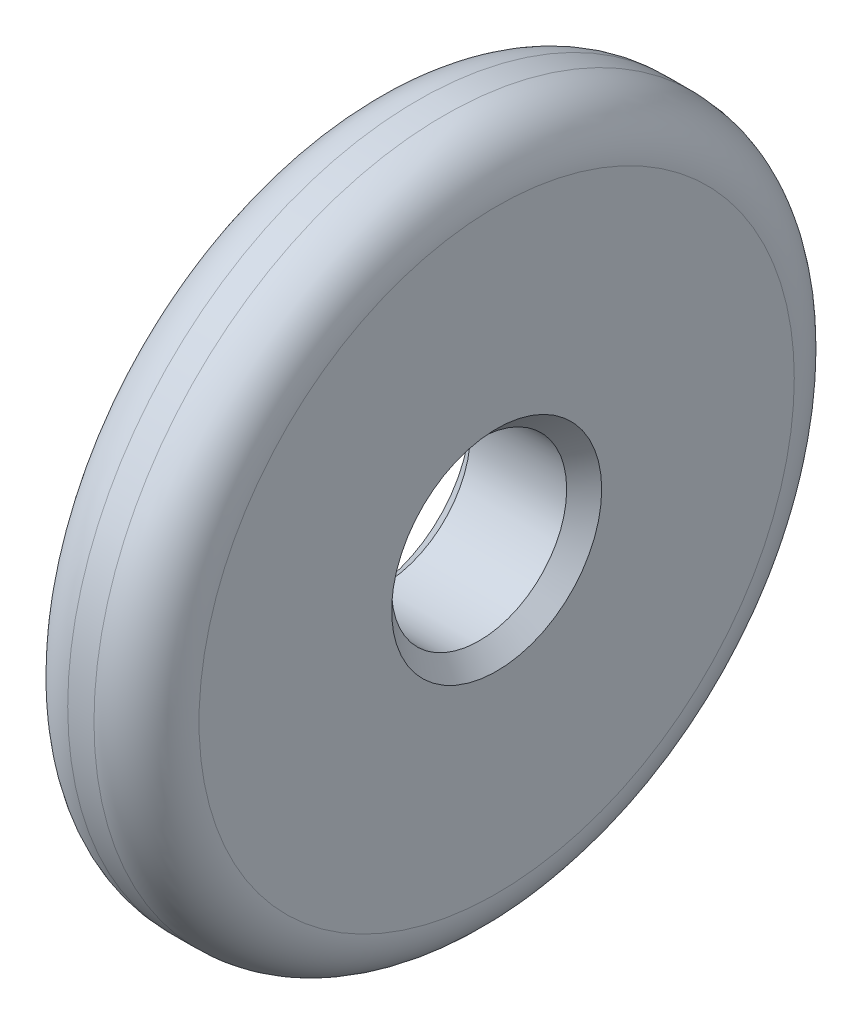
ISO-10303-21;
HEADER;
FILE_DESCRIPTION(('STEP AP214'),'2;1');
FILE_NAME('part.step','',(''),(''),'','','');
FILE_SCHEMA(('AUTOMOTIVE_DESIGN { 1 0 10303 214 1 1 1 1 }'));
ENDSEC;
DATA;
#1=APPLICATION_CONTEXT('core data for automotive mechanical design processes');
#2=APPLICATION_PROTOCOL_DEFINITION('international standard','automotive_design',2000,#1);
#3=PRODUCT_CONTEXT('',#1,'mechanical');
#4=PRODUCT('Part','Part','',(#3));
#5=PRODUCT_RELATED_PRODUCT_CATEGORY('part','',(#4));
#6=PRODUCT_DEFINITION_FORMATION('','',#4);
#7=PRODUCT_DEFINITION_CONTEXT('part definition',#1,'design');
#8=PRODUCT_DEFINITION('design','',#6,#7);
#9=PRODUCT_DEFINITION_SHAPE('','',#8);
#10=(LENGTH_UNIT() NAMED_UNIT(*) SI_UNIT(.MILLI.,.METRE.));
#11=(NAMED_UNIT(*) PLANE_ANGLE_UNIT() SI_UNIT($,.RADIAN.));
#12=(NAMED_UNIT(*) SI_UNIT($,.STERADIAN.) SOLID_ANGLE_UNIT());
#13=UNCERTAINTY_MEASURE_WITH_UNIT(LENGTH_MEASURE(1.E-05),#10,'distance_accuracy_value','');
#14=(GEOMETRIC_REPRESENTATION_CONTEXT(3) GLOBAL_UNCERTAINTY_ASSIGNED_CONTEXT((#13)) GLOBAL_UNIT_ASSIGNED_CONTEXT((#10,
#11,#12)) REPRESENTATION_CONTEXT('',''));
#15=CARTESIAN_POINT('',(0.,0.,0.));
#16=DIRECTION('',(0.,0.,1.));
#17=DIRECTION('',(1.,0.,0.));
#18=AXIS2_PLACEMENT_3D('',#15,#16,#17);
#19=CARTESIAN_POINT('',(3.75,0.,0.));
#20=DIRECTION('',(-1.,0.,0.));
#21=DIRECTION('',(0.,0.,1.));
#22=AXIS2_PLACEMENT_3D('',#19,#20,#21);
#23=CYLINDRICAL_SURFACE('',#22,20.);
#24=CARTESIAN_POINT('',(-0.75,0.,0.));
#25=DIRECTION('',(1.,0.,0.));
#26=DIRECTION('',(0.,0.,-1.));
#27=AXIS2_PLACEMENT_3D('',#24,#25,#26);
#28=CIRCLE('',#27,20.);
#29=CARTESIAN_POINT('',(-0.75,0.,-20.));
#30=VERTEX_POINT('',#29);
#31=EDGE_CURVE('E45',#30,#30,#28,.T.);
#32=ORIENTED_EDGE('',*,*,#31,.T.);
#33=EDGE_LOOP('',(#32));
#34=FACE_BOUND('',#33,.T.);
#35=CARTESIAN_POINT('',(0.75,0.,0.));
#36=DIRECTION('',(1.,0.,0.));
#37=DIRECTION('',(0.,0.,-1.));
#38=AXIS2_PLACEMENT_3D('',#35,#36,#37);
#39=CIRCLE('',#38,20.);
#40=CARTESIAN_POINT('',(0.75,0.,-20.));
#41=VERTEX_POINT('',#40);
#42=EDGE_CURVE('E49',#41,#41,#39,.F.);
#43=ORIENTED_EDGE('',*,*,#42,.T.);
#44=EDGE_LOOP('',(#43));
#45=FACE_BOUND('',#44,.T.);
#46=ADVANCED_FACE('F34',(#34,#45),#23,.T.);
#47=CARTESIAN_POINT('',(3.75,0.,0.));
#48=DIRECTION('',(1.,0.,0.));
#49=DIRECTION('',(0.,0.,-1.));
#50=AXIS2_PLACEMENT_3D('',#47,#48,#49);
#51=PLANE('',#50);
#52=CARTESIAN_POINT('',(3.75,0.,0.));
#53=DIRECTION('',(1.,0.,0.));
#54=DIRECTION('',(0.,0.,-1.));
#55=AXIS2_PLACEMENT_3D('',#52,#53,#54);
#56=CIRCLE('',#55,17.);
#57=CARTESIAN_POINT('',(3.75,0.,-17.));
#58=VERTEX_POINT('',#57);
#59=EDGE_CURVE('E10',#58,#58,#56,.T.);
#60=ORIENTED_EDGE('',*,*,#59,.T.);
#61=EDGE_LOOP('',(#60));
#62=FACE_BOUND('',#61,.T.);
#63=CARTESIAN_POINT('',(3.75,0.,0.));
#64=DIRECTION('',(1.,0.,0.));
#65=DIRECTION('',(0.,0.,-1.));
#66=AXIS2_PLACEMENT_3D('',#63,#64,#65);
#67=CIRCLE('',#66,5.99999999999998);
#68=CARTESIAN_POINT('',(3.75,0.,-5.99999999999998));
#69=VERTEX_POINT('',#68);
#70=EDGE_CURVE('E54',#69,#69,#67,.F.);
#71=ORIENTED_EDGE('',*,*,#70,.T.);
#72=EDGE_LOOP('',(#71));
#73=FACE_BOUND('',#72,.T.);
#74=ADVANCED_FACE('F87',(#62,#73),#51,.T.);
#75=CARTESIAN_POINT('',(-3.75,0.,0.));
#76=DIRECTION('',(1.,0.,0.));
#77=DIRECTION('',(0.,0.,-1.));
#78=AXIS2_PLACEMENT_3D('',#75,#76,#77);
#79=PLANE('',#78);
#80=CARTESIAN_POINT('',(-3.75,0.,0.));
#81=DIRECTION('',(1.,0.,0.));
#82=DIRECTION('',(0.,0.,-1.));
#83=AXIS2_PLACEMENT_3D('',#80,#81,#82);
#84=CIRCLE('',#83,17.);
#85=CARTESIAN_POINT('',(-3.75,0.,-17.));
#86=VERTEX_POINT('',#85);
#87=EDGE_CURVE('E41',#86,#86,#84,.F.);
#88=ORIENTED_EDGE('',*,*,#87,.T.);
#89=EDGE_LOOP('',(#88));
#90=FACE_BOUND('',#89,.T.);
#91=CARTESIAN_POINT('',(-3.75,0.,0.));
#92=DIRECTION('',(1.,0.,0.));
#93=DIRECTION('',(0.,0.,-1.));
#94=AXIS2_PLACEMENT_3D('',#91,#92,#93);
#95=CIRCLE('',#94,6.);
#96=CARTESIAN_POINT('',(-3.75,0.,-6.));
#97=VERTEX_POINT('',#96);
#98=EDGE_CURVE('E63',#97,#97,#95,.T.);
#99=ORIENTED_EDGE('',*,*,#98,.T.);
#100=EDGE_LOOP('',(#99));
#101=FACE_BOUND('',#100,.T.);
#102=ADVANCED_FACE('F67',(#90,#101),#79,.F.);
#103=CARTESIAN_POINT('',(-3.75,0.,0.));
#104=DIRECTION('',(1.,0.,0.));
#105=DIRECTION('',(0.,0.,-1.));
#106=AXIS2_PLACEMENT_3D('',#103,#104,#105);
#107=CYLINDRICAL_SURFACE('',#106,5.);
#108=CARTESIAN_POINT('',(-2.75,0.,0.));
#109=DIRECTION('',(1.,0.,0.));
#110=DIRECTION('',(0.,0.,-1.));
#111=AXIS2_PLACEMENT_3D('',#108,#109,#110);
#112=CIRCLE('',#111,5.);
#113=CARTESIAN_POINT('',(-2.75,0.,-5.));
#114=VERTEX_POINT('',#113);
#115=EDGE_CURVE('E57',#114,#114,#112,.F.);
#116=ORIENTED_EDGE('',*,*,#115,.T.);
#117=EDGE_LOOP('',(#116));
#118=FACE_BOUND('',#117,.T.);
#119=CARTESIAN_POINT('',(2.75000000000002,0.,0.));
#120=DIRECTION('',(1.,0.,0.));
#121=DIRECTION('',(0.,0.,-1.));
#122=AXIS2_PLACEMENT_3D('',#119,#120,#121);
#123=CIRCLE('',#122,5.);
#124=CARTESIAN_POINT('',(2.75000000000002,0.,-5.));
#125=VERTEX_POINT('',#124);
#126=EDGE_CURVE('E60',#125,#125,#123,.T.);
#127=ORIENTED_EDGE('',*,*,#126,.T.);
#128=EDGE_LOOP('',(#127));
#129=FACE_BOUND('',#128,.T.);
#130=ADVANCED_FACE('F72',(#118,#129),#107,.F.);
#131=CARTESIAN_POINT('',(-3.75,0.,0.));
#132=DIRECTION('',(-1.,0.,0.));
#133=DIRECTION('',(0.,0.,1.));
#134=AXIS2_PLACEMENT_3D('',#131,#132,#133);
#135=CONICAL_SURFACE('',#134,6.,0.785398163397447);
#136=ORIENTED_EDGE('',*,*,#115,.F.);
#137=EDGE_LOOP('',(#136));
#138=FACE_BOUND('',#137,.T.);
#139=ORIENTED_EDGE('',*,*,#98,.F.);
#140=EDGE_LOOP('',(#139));
#141=FACE_BOUND('',#140,.T.);
#142=ADVANCED_FACE('F69',(#138,#141),#135,.F.);
#143=CARTESIAN_POINT('',(2.75000000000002,0.,0.));
#144=DIRECTION('',(1.,0.,0.));
#145=DIRECTION('',(0.,0.,-1.));
#146=AXIS2_PLACEMENT_3D('',#143,#144,#145);
#147=CONICAL_SURFACE('',#146,5.,0.78539816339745);
#148=ORIENTED_EDGE('',*,*,#70,.F.);
#149=EDGE_LOOP('',(#148));
#150=FACE_BOUND('',#149,.T.);
#151=ORIENTED_EDGE('',*,*,#126,.F.);
#152=EDGE_LOOP('',(#151));
#153=FACE_BOUND('',#152,.T.);
#154=ADVANCED_FACE('F71',(#150,#153),#147,.F.);
#155=CARTESIAN_POINT('',(-0.75,0.,0.));
#156=DIRECTION('',(1.,0.,0.));
#157=DIRECTION('',(0.,0.,-1.));
#158=AXIS2_PLACEMENT_3D('',#155,#156,#157);
#159=TOROIDAL_SURFACE('',#158,17.,3.);
#160=ORIENTED_EDGE('',*,*,#87,.F.);
#161=EDGE_LOOP('',(#160));
#162=FACE_BOUND('',#161,.T.);
#163=ORIENTED_EDGE('',*,*,#31,.F.);
#164=EDGE_LOOP('',(#163));
#165=FACE_BOUND('',#164,.T.);
#166=ADVANCED_FACE('F79',(#162,#165),#159,.T.);
#167=CARTESIAN_POINT('',(0.75,0.,0.));
#168=DIRECTION('',(1.,0.,0.));
#169=DIRECTION('',(0.,0.,-1.));
#170=AXIS2_PLACEMENT_3D('',#167,#168,#169);
#171=TOROIDAL_SURFACE('',#170,17.,3.);
#172=ORIENTED_EDGE('',*,*,#42,.F.);
#173=EDGE_LOOP('',(#172));
#174=FACE_BOUND('',#173,.T.);
#175=ORIENTED_EDGE('',*,*,#59,.F.);
#176=EDGE_LOOP('',(#175));
#177=FACE_BOUND('',#176,.T.);
#178=ADVANCED_FACE('F36',(#174,#177),#171,.T.);
#179=CLOSED_SHELL('',(#46,#74,#102,#130,#142,#154,#166,#178));
#180=MANIFOLD_SOLID_BREP('B2',#179);
#181=ADVANCED_BREP_SHAPE_REPRESENTATION('',(#18,#180),#14);
#182=SHAPE_DEFINITION_REPRESENTATION(#9,#181);
ENDSEC;
END-ISO-10303-21;
